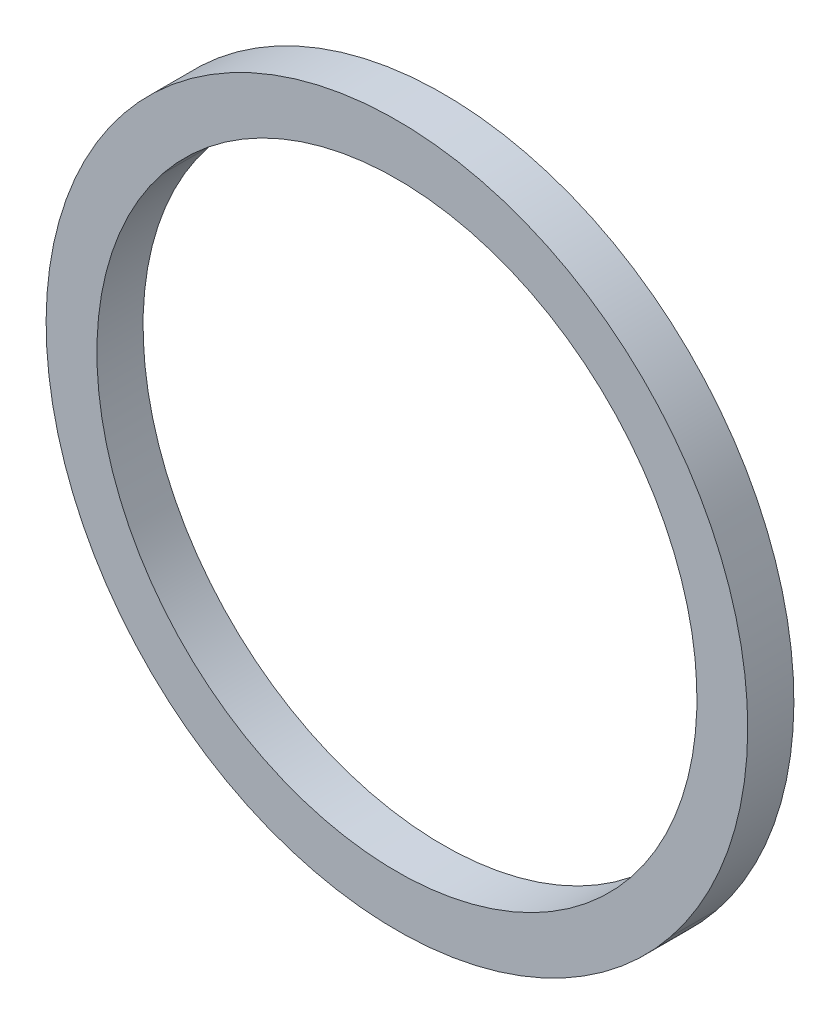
ISO-10303-21;
HEADER;
FILE_DESCRIPTION(('STEP AP214'),'2;1');
FILE_NAME('part.step','',(''),(''),'','','');
FILE_SCHEMA(('AUTOMOTIVE_DESIGN { 1 0 10303 214 1 1 1 1 }'));
ENDSEC;
DATA;
#1=APPLICATION_CONTEXT('core data for automotive mechanical design processes');
#2=APPLICATION_PROTOCOL_DEFINITION('international standard','automotive_design',2000,#1);
#3=PRODUCT_CONTEXT('',#1,'mechanical');
#4=PRODUCT('Part','Part','',(#3));
#5=PRODUCT_RELATED_PRODUCT_CATEGORY('part','',(#4));
#6=PRODUCT_DEFINITION_FORMATION('','',#4);
#7=PRODUCT_DEFINITION_CONTEXT('part definition',#1,'design');
#8=PRODUCT_DEFINITION('design','',#6,#7);
#9=PRODUCT_DEFINITION_SHAPE('','',#8);
#10=(LENGTH_UNIT() NAMED_UNIT(*) SI_UNIT(.MILLI.,.METRE.));
#11=(NAMED_UNIT(*) PLANE_ANGLE_UNIT() SI_UNIT($,.RADIAN.));
#12=(NAMED_UNIT(*) SI_UNIT($,.STERADIAN.) SOLID_ANGLE_UNIT());
#13=UNCERTAINTY_MEASURE_WITH_UNIT(LENGTH_MEASURE(1.E-05),#10,'distance_accuracy_value','');
#14=(GEOMETRIC_REPRESENTATION_CONTEXT(3) GLOBAL_UNCERTAINTY_ASSIGNED_CONTEXT((#13)) GLOBAL_UNIT_ASSIGNED_CONTEXT((#10,
#11,#12)) REPRESENTATION_CONTEXT('',''));
#15=CARTESIAN_POINT('',(0.,0.,0.));
#16=DIRECTION('',(0.,0.,1.));
#17=DIRECTION('',(1.,0.,0.));
#18=AXIS2_PLACEMENT_3D('',#15,#16,#17);
#19=CARTESIAN_POINT('',(0.,0.,0.));
#20=DIRECTION('',(0.,0.,-1.));
#21=DIRECTION('',(-0.780758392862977,0.624833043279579,0.));
#22=AXIS2_PLACEMENT_3D('',#19,#20,#21);
#23=CYLINDRICAL_SURFACE('',#22,16.25);
#24=DIRECTION('',(0.,0.,-1.));
#25=VECTOR('',#24,1.);
#26=CARTESIAN_POINT('',(12.6873238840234,-10.1535369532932,0.));
#27=LINE('',#26,#25);
#28=CARTESIAN_POINT('',(12.6873238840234,-10.1535369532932,0.));
#29=VERTEX_POINT('',#28);
#30=CARTESIAN_POINT('',(12.6873238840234,-10.1535369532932,-2.5));
#31=VERTEX_POINT('',#30);
#32=EDGE_CURVE('E70',#29,#31,#27,.T.);
#33=ORIENTED_EDGE('',*,*,#32,.F.);
#34=CARTESIAN_POINT('',(0.,0.,0.));
#35=DIRECTION('',(0.,0.,1.));
#36=DIRECTION('',(0.780758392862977,-0.624833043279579,0.));
#37=AXIS2_PLACEMENT_3D('',#34,#35,#36);
#38=CIRCLE('',#37,16.25);
#39=CARTESIAN_POINT('',(-12.6873238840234,10.1535369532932,0.));
#40=VERTEX_POINT('',#39);
#41=EDGE_CURVE('E65',#29,#40,#38,.T.);
#42=ORIENTED_EDGE('',*,*,#41,.T.);
#43=DIRECTION('',(0.,0.,-1.));
#44=VECTOR('',#43,1.);
#45=CARTESIAN_POINT('',(-12.6873238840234,10.1535369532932,0.));
#46=LINE('',#45,#44);
#47=CARTESIAN_POINT('',(-12.6873238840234,10.1535369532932,-2.5));
#48=VERTEX_POINT('',#47);
#49=EDGE_CURVE('E67',#40,#48,#46,.T.);
#50=ORIENTED_EDGE('',*,*,#49,.T.);
#51=CARTESIAN_POINT('',(0.,0.,-2.5));
#52=DIRECTION('',(0.,0.,1.));
#53=DIRECTION('',(0.780758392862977,-0.624833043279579,0.));
#54=AXIS2_PLACEMENT_3D('',#51,#52,#53);
#55=CIRCLE('',#54,16.25);
#56=EDGE_CURVE('E10',#31,#48,#55,.T.);
#57=ORIENTED_EDGE('',*,*,#56,.F.);
#58=EDGE_LOOP('',(#33,#42,#50,#57));
#59=FACE_BOUND('',#58,.T.);
#60=ADVANCED_FACE('F15',(#59),#23,.F.);
#61=CARTESIAN_POINT('',(0.,0.,0.));
#62=DIRECTION('',(0.,0.,-1.));
#63=DIRECTION('',(-0.780758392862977,0.624833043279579,0.));
#64=AXIS2_PLACEMENT_3D('',#61,#62,#63);
#65=CYLINDRICAL_SURFACE('',#64,19.);
#66=DIRECTION('',(0.,0.,-1.));
#67=VECTOR('',#66,1.);
#68=CARTESIAN_POINT('',(14.8344094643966,-11.871827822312,0.));
#69=LINE('',#68,#67);
#70=CARTESIAN_POINT('',(14.8344094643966,-11.871827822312,0.));
#71=VERTEX_POINT('',#70);
#72=CARTESIAN_POINT('',(14.8344094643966,-11.871827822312,-2.5));
#73=VERTEX_POINT('',#72);
#74=EDGE_CURVE('E99',#71,#73,#69,.T.);
#75=ORIENTED_EDGE('',*,*,#74,.F.);
#76=CARTESIAN_POINT('',(0.,0.,0.));
#77=DIRECTION('',(0.,0.,1.));
#78=DIRECTION('',(0.780758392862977,-0.624833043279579,0.));
#79=AXIS2_PLACEMENT_3D('',#76,#77,#78);
#80=CIRCLE('',#79,19.);
#81=CARTESIAN_POINT('',(-14.8344094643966,11.871827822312,0.));
#82=VERTEX_POINT('',#81);
#83=EDGE_CURVE('E75',#82,#71,#80,.T.);
#84=ORIENTED_EDGE('',*,*,#83,.F.);
#85=DIRECTION('',(0.,0.,-1.));
#86=VECTOR('',#85,1.);
#87=CARTESIAN_POINT('',(-14.8344094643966,11.871827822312,0.));
#88=LINE('',#87,#86);
#89=CARTESIAN_POINT('',(-14.8344094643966,11.871827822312,-2.5));
#90=VERTEX_POINT('',#89);
#91=EDGE_CURVE('E107',#82,#90,#88,.T.);
#92=ORIENTED_EDGE('',*,*,#91,.T.);
#93=CARTESIAN_POINT('',(0.,0.,-2.5));
#94=DIRECTION('',(0.,0.,1.));
#95=DIRECTION('',(0.780758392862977,-0.624833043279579,0.));
#96=AXIS2_PLACEMENT_3D('',#93,#94,#95);
#97=CIRCLE('',#96,19.);
#98=EDGE_CURVE('E23',#90,#73,#97,.T.);
#99=ORIENTED_EDGE('',*,*,#98,.T.);
#100=EDGE_LOOP('',(#75,#84,#92,#99));
#101=FACE_BOUND('',#100,.T.);
#102=ADVANCED_FACE('F114',(#101),#65,.T.);
#103=CARTESIAN_POINT('',(0.,0.,-2.5));
#104=DIRECTION('',(0.,0.,1.));
#105=DIRECTION('',(0.780758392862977,-0.624833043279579,0.));
#106=AXIS2_PLACEMENT_3D('',#103,#104,#105);
#107=PLANE('',#106);
#108=CARTESIAN_POINT('',(0.,0.,-2.5));
#109=DIRECTION('',(0.,0.,1.));
#110=DIRECTION('',(0.780758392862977,-0.624833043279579,0.));
#111=AXIS2_PLACEMENT_3D('',#108,#109,#110);
#112=CIRCLE('',#111,16.25);
#113=EDGE_CURVE('E80',#48,#31,#112,.T.);
#114=ORIENTED_EDGE('',*,*,#113,.T.);
#115=ORIENTED_EDGE('',*,*,#56,.T.);
#116=EDGE_LOOP('',(#114,#115));
#117=FACE_BOUND('',#116,.T.);
#118=ORIENTED_EDGE('',*,*,#98,.F.);
#119=CARTESIAN_POINT('',(0.,0.,-2.5));
#120=DIRECTION('',(0.,0.,1.));
#121=DIRECTION('',(0.780758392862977,-0.624833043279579,0.));
#122=AXIS2_PLACEMENT_3D('',#119,#120,#121);
#123=CIRCLE('',#122,19.);
#124=EDGE_CURVE('E103',#73,#90,#123,.T.);
#125=ORIENTED_EDGE('',*,*,#124,.F.);
#126=EDGE_LOOP('',(#118,#125));
#127=FACE_BOUND('',#126,.T.);
#128=ADVANCED_FACE('F117',(#117,#127),#107,.F.);
#129=CARTESIAN_POINT('',(0.,0.,0.));
#130=DIRECTION('',(0.,0.,1.));
#131=DIRECTION('',(0.780758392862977,-0.624833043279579,0.));
#132=AXIS2_PLACEMENT_3D('',#129,#130,#131);
#133=PLANE('',#132);
#134=CARTESIAN_POINT('',(0.,0.,0.));
#135=DIRECTION('',(0.,0.,1.));
#136=DIRECTION('',(0.780758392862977,-0.624833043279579,0.));
#137=AXIS2_PLACEMENT_3D('',#134,#135,#136);
#138=CIRCLE('',#137,16.25);
#139=EDGE_CURVE('E78',#40,#29,#138,.T.);
#140=ORIENTED_EDGE('',*,*,#139,.F.);
#141=ORIENTED_EDGE('',*,*,#41,.F.);
#142=EDGE_LOOP('',(#140,#141));
#143=FACE_BOUND('',#142,.T.);
#144=ORIENTED_EDGE('',*,*,#83,.T.);
#145=CARTESIAN_POINT('',(0.,0.,0.));
#146=DIRECTION('',(0.,0.,1.));
#147=DIRECTION('',(0.780758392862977,-0.624833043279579,0.));
#148=AXIS2_PLACEMENT_3D('',#145,#146,#147);
#149=CIRCLE('',#148,19.);
#150=EDGE_CURVE('E82',#71,#82,#149,.T.);
#151=ORIENTED_EDGE('',*,*,#150,.T.);
#152=EDGE_LOOP('',(#144,#151));
#153=FACE_BOUND('',#152,.T.);
#154=ADVANCED_FACE('F84',(#143,#153),#133,.T.);
#155=CARTESIAN_POINT('',(0.,0.,0.));
#156=DIRECTION('',(0.,0.,-1.));
#157=DIRECTION('',(-0.780758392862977,0.624833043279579,0.));
#158=AXIS2_PLACEMENT_3D('',#155,#156,#157);
#159=CYLINDRICAL_SURFACE('',#158,19.);
#160=ORIENTED_EDGE('',*,*,#150,.F.);
#161=ORIENTED_EDGE('',*,*,#74,.T.);
#162=ORIENTED_EDGE('',*,*,#124,.T.);
#163=ORIENTED_EDGE('',*,*,#91,.F.);
#164=EDGE_LOOP('',(#160,#161,#162,#163));
#165=FACE_BOUND('',#164,.T.);
#166=ADVANCED_FACE('F116',(#165),#159,.T.);
#167=CARTESIAN_POINT('',(0.,0.,0.));
#168=DIRECTION('',(0.,0.,-1.));
#169=DIRECTION('',(-0.780758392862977,0.624833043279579,0.));
#170=AXIS2_PLACEMENT_3D('',#167,#168,#169);
#171=CYLINDRICAL_SURFACE('',#170,16.25);
#172=ORIENTED_EDGE('',*,*,#139,.T.);
#173=ORIENTED_EDGE('',*,*,#32,.T.);
#174=ORIENTED_EDGE('',*,*,#113,.F.);
#175=ORIENTED_EDGE('',*,*,#49,.F.);
#176=EDGE_LOOP('',(#172,#173,#174,#175));
#177=FACE_BOUND('',#176,.T.);
#178=ADVANCED_FACE('F77',(#177),#171,.F.);
#179=CLOSED_SHELL('',(#60,#102,#128,#154,#166,#178));
#180=MANIFOLD_SOLID_BREP('B1',#179);
#181=ADVANCED_BREP_SHAPE_REPRESENTATION('',(#18,#180),#14);
#182=SHAPE_DEFINITION_REPRESENTATION(#9,#181);
ENDSEC;
END-ISO-10303-21;
